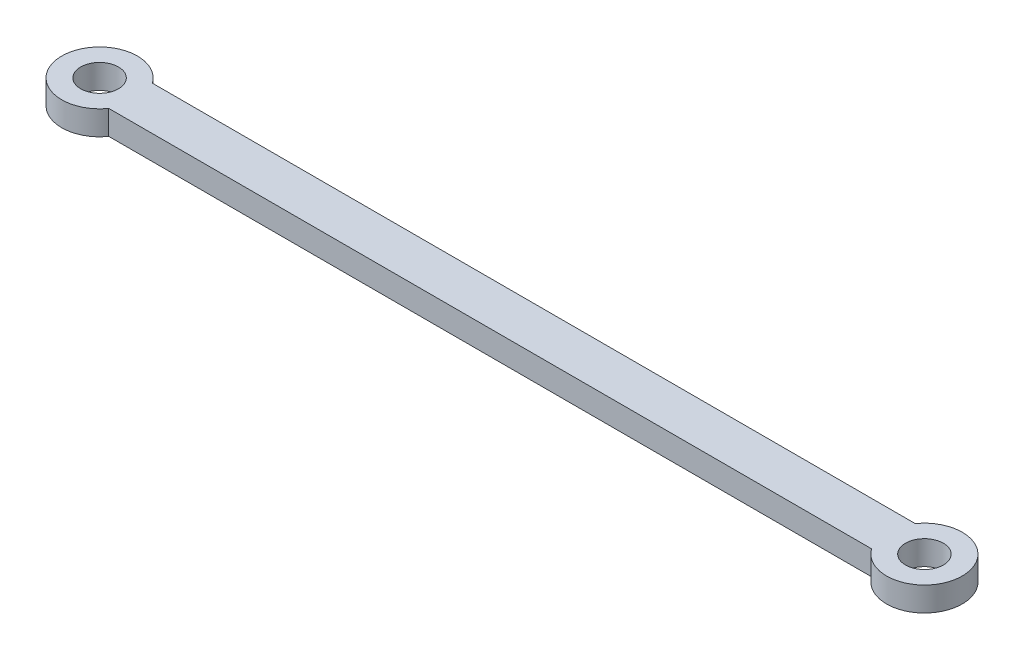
ISO-10303-21;
HEADER;
FILE_DESCRIPTION(('STEP AP214'),'2;1');
FILE_NAME('part.step','',(''),(''),'','','');
FILE_SCHEMA(('AUTOMOTIVE_DESIGN { 1 0 10303 214 1 1 1 1 }'));
ENDSEC;
DATA;
#1=APPLICATION_CONTEXT('core data for automotive mechanical design processes');
#2=APPLICATION_PROTOCOL_DEFINITION('international standard','automotive_design',2000,#1);
#3=PRODUCT_CONTEXT('',#1,'mechanical');
#4=PRODUCT('Part','Part','',(#3));
#5=PRODUCT_RELATED_PRODUCT_CATEGORY('part','',(#4));
#6=PRODUCT_DEFINITION_FORMATION('','',#4);
#7=PRODUCT_DEFINITION_CONTEXT('part definition',#1,'design');
#8=PRODUCT_DEFINITION('design','',#6,#7);
#9=PRODUCT_DEFINITION_SHAPE('','',#8);
#10=(LENGTH_UNIT() NAMED_UNIT(*) SI_UNIT(.MILLI.,.METRE.));
#11=(NAMED_UNIT(*) PLANE_ANGLE_UNIT() SI_UNIT($,.RADIAN.));
#12=(NAMED_UNIT(*) SI_UNIT($,.STERADIAN.) SOLID_ANGLE_UNIT());
#13=UNCERTAINTY_MEASURE_WITH_UNIT(LENGTH_MEASURE(1.E-05),#10,'distance_accuracy_value','');
#14=(GEOMETRIC_REPRESENTATION_CONTEXT(3) GLOBAL_UNCERTAINTY_ASSIGNED_CONTEXT((#13)) GLOBAL_UNIT_ASSIGNED_CONTEXT((#10,
#11,#12)) REPRESENTATION_CONTEXT('',''));
#15=CARTESIAN_POINT('',(0.,0.,0.));
#16=DIRECTION('',(0.,0.,1.));
#17=DIRECTION('',(1.,0.,0.));
#18=AXIS2_PLACEMENT_3D('',#15,#16,#17);
#19=CARTESIAN_POINT('',(85.,5.,0.));
#20=DIRECTION('',(0.,1.,0.));
#21=DIRECTION('',(0.,0.,1.));
#22=AXIS2_PLACEMENT_3D('',#19,#20,#21);
#23=PLANE('',#22);
#24=CARTESIAN_POINT('',(85.,5.,0.));
#25=DIRECTION('',(0.,1.,0.));
#26=DIRECTION('',(0.,0.,1.));
#27=AXIS2_PLACEMENT_3D('',#24,#25,#26);
#28=CIRCLE('',#27,3.9);
#29=CARTESIAN_POINT('',(85.,5.,3.9));
#30=VERTEX_POINT('',#29);
#31=EDGE_CURVE('E103',#30,#30,#28,.T.);
#32=ORIENTED_EDGE('',*,*,#31,.F.);
#33=EDGE_LOOP('',(#32));
#34=FACE_BOUND('',#33,.T.);
#35=CARTESIAN_POINT('',(85.,5.,0.));
#36=DIRECTION('',(0.,1.,0.));
#37=DIRECTION('',(0.,0.,1.));
#38=AXIS2_PLACEMENT_3D('',#35,#36,#37);
#39=CIRCLE('',#38,7.81024967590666);
#40=CARTESIAN_POINT('',(78.6164273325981,5.,4.5));
#41=VERTEX_POINT('',#40);
#42=CARTESIAN_POINT('',(78.6164273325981,5.,-4.5));
#43=VERTEX_POINT('',#42);
#44=EDGE_CURVE('E88',#41,#43,#39,.T.);
#45=ORIENTED_EDGE('',*,*,#44,.T.);
#46=DIRECTION('',(-1.,0.,0.));
#47=VECTOR('',#46,1.);
#48=CARTESIAN_POINT('',(-78.6164273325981,5.,-4.5));
#49=LINE('',#48,#47);
#50=CARTESIAN_POINT('',(-78.6164273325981,5.,-4.5));
#51=VERTEX_POINT('',#50);
#52=EDGE_CURVE('E83',#43,#51,#49,.T.);
#53=ORIENTED_EDGE('',*,*,#52,.T.);
#54=CARTESIAN_POINT('',(-85.,5.,0.));
#55=DIRECTION('',(0.,1.,0.));
#56=DIRECTION('',(0.,0.,-1.));
#57=AXIS2_PLACEMENT_3D('',#54,#55,#56);
#58=CIRCLE('',#57,7.81024967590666);
#59=CARTESIAN_POINT('',(-78.6164273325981,5.,4.5));
#60=VERTEX_POINT('',#59);
#61=EDGE_CURVE('E86',#51,#60,#58,.T.);
#62=ORIENTED_EDGE('',*,*,#61,.T.);
#63=DIRECTION('',(1.,0.,0.));
#64=VECTOR('',#63,1.);
#65=CARTESIAN_POINT('',(-78.6164273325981,5.,4.5));
#66=LINE('',#65,#64);
#67=EDGE_CURVE('E53',#60,#41,#66,.T.);
#68=ORIENTED_EDGE('',*,*,#67,.T.);
#69=EDGE_LOOP('',(#45,#53,#62,#68));
#70=FACE_BOUND('',#69,.T.);
#71=CARTESIAN_POINT('',(-85.,5.,0.));
#72=DIRECTION('',(0.,1.,0.));
#73=DIRECTION('',(0.,0.,-1.));
#74=AXIS2_PLACEMENT_3D('',#71,#72,#73);
#75=CIRCLE('',#74,3.9);
#76=CARTESIAN_POINT('',(-85.,5.,-3.9));
#77=VERTEX_POINT('',#76);
#78=EDGE_CURVE('E118',#77,#77,#75,.T.);
#79=ORIENTED_EDGE('',*,*,#78,.F.);
#80=EDGE_LOOP('',(#79));
#81=FACE_BOUND('',#80,.T.);
#82=ADVANCED_FACE('F36',(#34,#70,#81),#23,.T.);
#83=CARTESIAN_POINT('',(85.,0.,0.));
#84=DIRECTION('',(0.,1.,0.));
#85=DIRECTION('',(0.,0.,1.));
#86=AXIS2_PLACEMENT_3D('',#83,#84,#85);
#87=PLANE('',#86);
#88=CARTESIAN_POINT('',(85.,0.,0.));
#89=DIRECTION('',(0.,1.,0.));
#90=DIRECTION('',(0.,0.,1.));
#91=AXIS2_PLACEMENT_3D('',#88,#89,#90);
#92=CIRCLE('',#91,7.81024967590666);
#93=CARTESIAN_POINT('',(78.6164273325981,0.,4.5));
#94=VERTEX_POINT('',#93);
#95=CARTESIAN_POINT('',(78.6164273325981,0.,-4.5));
#96=VERTEX_POINT('',#95);
#97=EDGE_CURVE('E100',#94,#96,#92,.T.);
#98=ORIENTED_EDGE('',*,*,#97,.F.);
#99=DIRECTION('',(1.,0.,0.));
#100=VECTOR('',#99,1.);
#101=CARTESIAN_POINT('',(-78.6164273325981,0.,4.5));
#102=LINE('',#101,#100);
#103=CARTESIAN_POINT('',(-78.6164273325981,0.,4.5));
#104=VERTEX_POINT('',#103);
#105=EDGE_CURVE('E76',#104,#94,#102,.T.);
#106=ORIENTED_EDGE('',*,*,#105,.F.);
#107=CARTESIAN_POINT('',(-85.,0.,0.));
#108=DIRECTION('',(0.,1.,0.));
#109=DIRECTION('',(0.,0.,-1.));
#110=AXIS2_PLACEMENT_3D('',#107,#108,#109);
#111=CIRCLE('',#110,7.81024967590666);
#112=CARTESIAN_POINT('',(-78.6164273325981,0.,-4.5));
#113=VERTEX_POINT('',#112);
#114=EDGE_CURVE('E70',#113,#104,#111,.T.);
#115=ORIENTED_EDGE('',*,*,#114,.F.);
#116=DIRECTION('',(-1.,0.,0.));
#117=VECTOR('',#116,1.);
#118=CARTESIAN_POINT('',(-78.6164273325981,0.,-4.5));
#119=LINE('',#118,#117);
#120=EDGE_CURVE('E92',#96,#113,#119,.T.);
#121=ORIENTED_EDGE('',*,*,#120,.F.);
#122=EDGE_LOOP('',(#98,#106,#115,#121));
#123=FACE_BOUND('',#122,.T.);
#124=CARTESIAN_POINT('',(85.,0.,0.));
#125=DIRECTION('',(0.,1.,0.));
#126=DIRECTION('',(0.,0.,1.));
#127=AXIS2_PLACEMENT_3D('',#124,#125,#126);
#128=CIRCLE('',#127,3.9);
#129=CARTESIAN_POINT('',(85.,0.,3.9));
#130=VERTEX_POINT('',#129);
#131=EDGE_CURVE('E115',#130,#130,#128,.T.);
#132=ORIENTED_EDGE('',*,*,#131,.T.);
#133=EDGE_LOOP('',(#132));
#134=FACE_BOUND('',#133,.T.);
#135=CARTESIAN_POINT('',(-85.,0.,0.));
#136=DIRECTION('',(0.,1.,0.));
#137=DIRECTION('',(0.,0.,-1.));
#138=AXIS2_PLACEMENT_3D('',#135,#136,#137);
#139=CIRCLE('',#138,3.9);
#140=CARTESIAN_POINT('',(-85.,0.,-3.9));
#141=VERTEX_POINT('',#140);
#142=EDGE_CURVE('E121',#141,#141,#139,.T.);
#143=ORIENTED_EDGE('',*,*,#142,.T.);
#144=EDGE_LOOP('',(#143));
#145=FACE_BOUND('',#144,.T.);
#146=ADVANCED_FACE('F111',(#123,#134,#145),#87,.F.);
#147=CARTESIAN_POINT('',(85.,5.,0.));
#148=DIRECTION('',(0.,-1.,0.));
#149=DIRECTION('',(0.,0.,-1.));
#150=AXIS2_PLACEMENT_3D('',#147,#148,#149);
#151=CYLINDRICAL_SURFACE('',#150,7.81024967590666);
#152=ORIENTED_EDGE('',*,*,#97,.T.);
#153=DIRECTION('',(0.,-1.,0.));
#154=VECTOR('',#153,1.);
#155=CARTESIAN_POINT('',(78.6164273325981,5.,-4.5));
#156=LINE('',#155,#154);
#157=EDGE_CURVE('E11',#43,#96,#156,.T.);
#158=ORIENTED_EDGE('',*,*,#157,.F.);
#159=ORIENTED_EDGE('',*,*,#44,.F.);
#160=DIRECTION('',(0.,-1.,0.));
#161=VECTOR('',#160,1.);
#162=CARTESIAN_POINT('',(78.6164273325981,5.,4.5));
#163=LINE('',#162,#161);
#164=EDGE_CURVE('E96',#41,#94,#163,.T.);
#165=ORIENTED_EDGE('',*,*,#164,.T.);
#166=EDGE_LOOP('',(#152,#158,#159,#165));
#167=FACE_BOUND('',#166,.T.);
#168=ADVANCED_FACE('F38',(#167),#151,.T.);
#169=CARTESIAN_POINT('',(-78.6164273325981,5.,-4.5));
#170=DIRECTION('',(0.,0.,1.));
#171=DIRECTION('',(1.,0.,0.));
#172=AXIS2_PLACEMENT_3D('',#169,#170,#171);
#173=PLANE('',#172);
#174=ORIENTED_EDGE('',*,*,#120,.T.);
#175=DIRECTION('',(0.,-1.,0.));
#176=VECTOR('',#175,1.);
#177=CARTESIAN_POINT('',(-78.6164273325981,5.,-4.5));
#178=LINE('',#177,#176);
#179=EDGE_CURVE('E45',#51,#113,#178,.T.);
#180=ORIENTED_EDGE('',*,*,#179,.F.);
#181=ORIENTED_EDGE('',*,*,#52,.F.);
#182=ORIENTED_EDGE('',*,*,#157,.T.);
#183=EDGE_LOOP('',(#174,#180,#181,#182));
#184=FACE_BOUND('',#183,.T.);
#185=ADVANCED_FACE('F91',(#184),#173,.F.);
#186=CARTESIAN_POINT('',(-85.,5.,0.));
#187=DIRECTION('',(0.,-1.,0.));
#188=DIRECTION('',(0.,0.,-1.));
#189=AXIS2_PLACEMENT_3D('',#186,#187,#188);
#190=CYLINDRICAL_SURFACE('',#189,7.81024967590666);
#191=ORIENTED_EDGE('',*,*,#114,.T.);
#192=DIRECTION('',(0.,-1.,0.));
#193=VECTOR('',#192,1.);
#194=CARTESIAN_POINT('',(-78.6164273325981,5.,4.5));
#195=LINE('',#194,#193);
#196=EDGE_CURVE('E93',#60,#104,#195,.T.);
#197=ORIENTED_EDGE('',*,*,#196,.F.);
#198=ORIENTED_EDGE('',*,*,#61,.F.);
#199=ORIENTED_EDGE('',*,*,#179,.T.);
#200=EDGE_LOOP('',(#191,#197,#198,#199));
#201=FACE_BOUND('',#200,.T.);
#202=ADVANCED_FACE('F94',(#201),#190,.T.);
#203=CARTESIAN_POINT('',(-78.6164273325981,5.,4.5));
#204=DIRECTION('',(0.,0.,-1.));
#205=DIRECTION('',(-1.,0.,0.));
#206=AXIS2_PLACEMENT_3D('',#203,#204,#205);
#207=PLANE('',#206);
#208=ORIENTED_EDGE('',*,*,#105,.T.);
#209=ORIENTED_EDGE('',*,*,#164,.F.);
#210=ORIENTED_EDGE('',*,*,#67,.F.);
#211=ORIENTED_EDGE('',*,*,#196,.T.);
#212=EDGE_LOOP('',(#208,#209,#210,#211));
#213=FACE_BOUND('',#212,.T.);
#214=ADVANCED_FACE('F108',(#213),#207,.F.);
#215=CARTESIAN_POINT('',(85.,5.,0.));
#216=DIRECTION('',(0.,-1.,0.));
#217=DIRECTION('',(0.,0.,-1.));
#218=AXIS2_PLACEMENT_3D('',#215,#216,#217);
#219=CYLINDRICAL_SURFACE('',#218,3.9);
#220=ORIENTED_EDGE('',*,*,#31,.T.);
#221=EDGE_LOOP('',(#220));
#222=FACE_BOUND('',#221,.T.);
#223=ORIENTED_EDGE('',*,*,#131,.F.);
#224=EDGE_LOOP('',(#223));
#225=FACE_BOUND('',#224,.T.);
#226=ADVANCED_FACE('F138',(#222,#225),#219,.F.);
#227=CARTESIAN_POINT('',(-85.,5.,0.));
#228=DIRECTION('',(0.,-1.,0.));
#229=DIRECTION('',(0.,0.,-1.));
#230=AXIS2_PLACEMENT_3D('',#227,#228,#229);
#231=CYLINDRICAL_SURFACE('',#230,3.9);
#232=ORIENTED_EDGE('',*,*,#78,.T.);
#233=EDGE_LOOP('',(#232));
#234=FACE_BOUND('',#233,.T.);
#235=ORIENTED_EDGE('',*,*,#142,.F.);
#236=EDGE_LOOP('',(#235));
#237=FACE_BOUND('',#236,.T.);
#238=ADVANCED_FACE('F127',(#234,#237),#231,.F.);
#239=CLOSED_SHELL('',(#82,#146,#168,#185,#202,#214,#226,#238));
#240=MANIFOLD_SOLID_BREP('B2',#239);
#241=ADVANCED_BREP_SHAPE_REPRESENTATION('',(#18,#240),#14);
#242=SHAPE_DEFINITION_REPRESENTATION(#9,#241);
ENDSEC;
END-ISO-10303-21;
